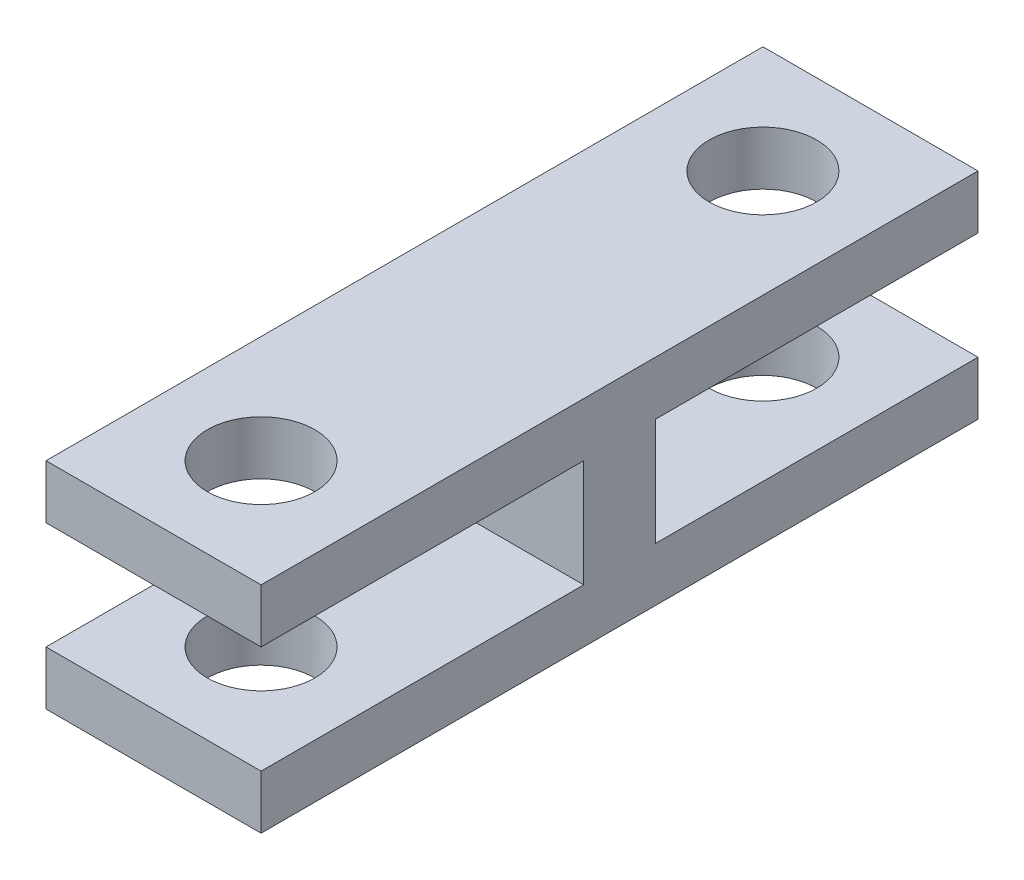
from build123d import *

# Parameters (mm, degrees)
BOSS_EXTRUDE1_DEPTH = 6
SKETCH2_R           = 1.5
CUT_EXTRUDE1_DEPTH  = 18.598835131


with BuildPart() as part:
    # Sketch1 → Boss-Extrude1 (new body)
    with BuildSketch(Plane(origin=(0, 0, 0), x_dir=(0, 0, -1), z_dir=(1, 0, 0))):
        Polygon((-4.581861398, -8.60824031), (4.418138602, -8.60824031), (4.418138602, -5.60824031), (-4.581861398, -5.60824031), (-4.581861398, -4.10824031), (15.418138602, -4.10824031), (15.418138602, -5.60824031), (6.418138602, -5.60824031), (6.418138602, -8.60824031), (15.418138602, -8.60824031), (15.418138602, -10.10824031), (-4.581861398, -10.10824031), align=None)
    extrude(amount=BOSS_EXTRUDE1_DEPTH)

    # Sketch2 → Cut-Extrude1 (cut, through all)
    with BuildSketch(Plane(origin=(0, -4.10824031, 0), x_dir=(1, 0, 0), z_dir=(0, 1, 0))):
        with Locations(Location((3, -1.581861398, 0), (0, 0, 270))):
            Circle(SKETCH2_R)
        with Locations(Location((3, 12.418138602, 0), (0, 0, 270))):
            Circle(SKETCH2_R)
    extrude(amount=-CUT_EXTRUDE1_DEPTH, mode=Mode.SUBTRACT)


solid = part.part
